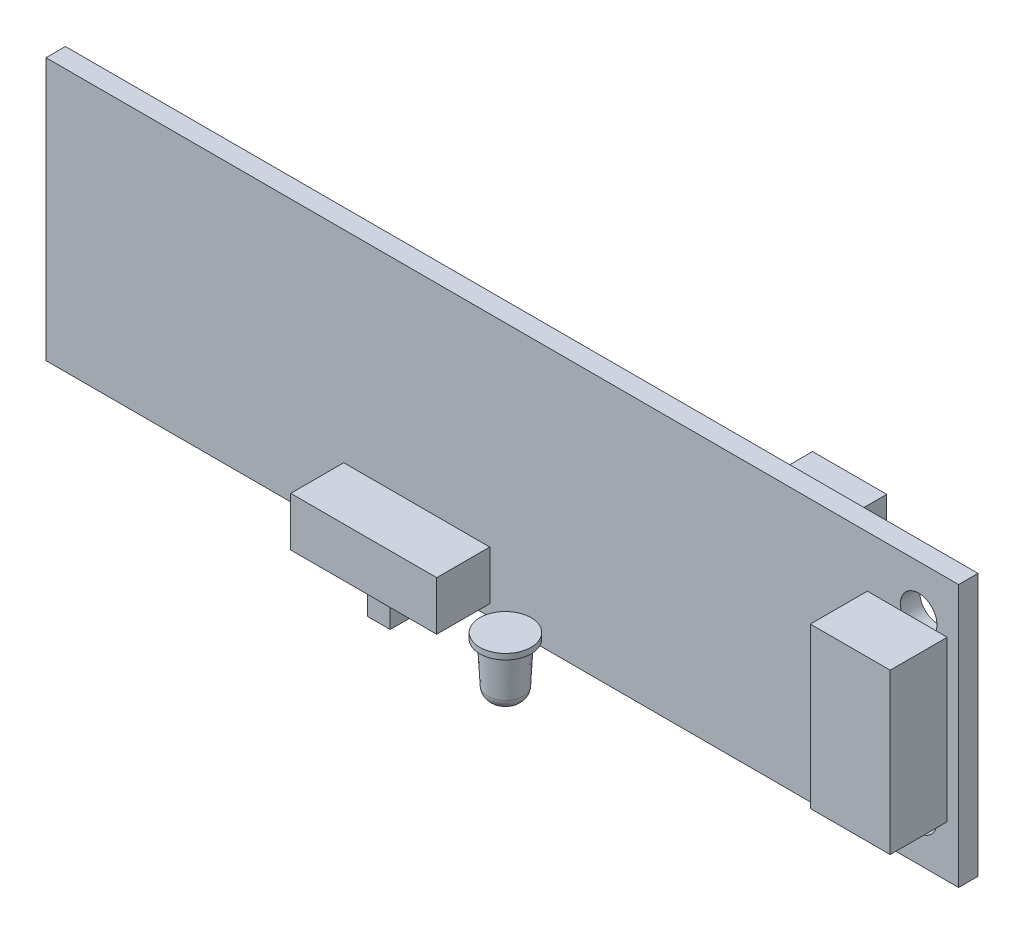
ISO-10303-21;
HEADER;
FILE_DESCRIPTION(('STEP AP214'),'2;1');
FILE_NAME('part.step','',(''),(''),'','','');
FILE_SCHEMA(('AUTOMOTIVE_DESIGN { 1 0 10303 214 1 1 1 1 }'));
ENDSEC;
DATA;
#1=APPLICATION_CONTEXT('core data for automotive mechanical design processes');
#2=APPLICATION_PROTOCOL_DEFINITION('international standard','automotive_design',2000,#1);
#3=PRODUCT_CONTEXT('',#1,'mechanical');
#4=PRODUCT('Part','Part','',(#3));
#5=PRODUCT_RELATED_PRODUCT_CATEGORY('part','',(#4));
#6=PRODUCT_DEFINITION_FORMATION('','',#4);
#7=PRODUCT_DEFINITION_CONTEXT('part definition',#1,'design');
#8=PRODUCT_DEFINITION('design','',#6,#7);
#9=PRODUCT_DEFINITION_SHAPE('','',#8);
#10=(LENGTH_UNIT() NAMED_UNIT(*) SI_UNIT(.MILLI.,.METRE.));
#11=(NAMED_UNIT(*) PLANE_ANGLE_UNIT() SI_UNIT($,.RADIAN.));
#12=(NAMED_UNIT(*) SI_UNIT($,.STERADIAN.) SOLID_ANGLE_UNIT());
#13=UNCERTAINTY_MEASURE_WITH_UNIT(LENGTH_MEASURE(1.E-05),#10,'distance_accuracy_value','');
#14=(GEOMETRIC_REPRESENTATION_CONTEXT(3) GLOBAL_UNCERTAINTY_ASSIGNED_CONTEXT((#13)) GLOBAL_UNIT_ASSIGNED_CONTEXT((#10,
#11,#12)) REPRESENTATION_CONTEXT('',''));
#15=CARTESIAN_POINT('',(0.,0.,0.));
#16=DIRECTION('',(0.,0.,1.));
#17=DIRECTION('',(1.,0.,0.));
#18=AXIS2_PLACEMENT_3D('',#15,#16,#17);
#19=CARTESIAN_POINT('',(3.275,-9.5,4.7));
#20=DIRECTION('',(0.,1.,0.));
#21=DIRECTION('',(0.,0.,-1.));
#22=AXIS2_PLACEMENT_3D('',#19,#20,#21);
#23=CONICAL_SURFACE('',#22,1.75,0.05235987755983);
#24=CARTESIAN_POINT('',(3.275,-13.0523359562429,4.7));
#25=DIRECTION('',(0.,1.,0.));
#26=DIRECTION('',(0.,0.,1.));
#27=AXIS2_PLACEMENT_3D('',#24,#25,#26);
#28=CIRCLE('',#27,1.56382996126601);
#29=CARTESIAN_POINT('',(3.275,-13.0523359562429,6.26382996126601));
#30=VERTEX_POINT('',#29);
#31=EDGE_CURVE('E11',#30,#30,#28,.T.);
#32=ORIENTED_EDGE('',*,*,#31,.T.);
#33=EDGE_LOOP('',(#32));
#34=FACE_BOUND('',#33,.T.);
#35=CARTESIAN_POINT('',(3.275,-9.5,4.7));
#36=DIRECTION('',(0.,1.,0.));
#37=DIRECTION('',(0.,0.,1.));
#38=AXIS2_PLACEMENT_3D('',#35,#36,#37);
#39=CIRCLE('',#38,1.75);
#40=CARTESIAN_POINT('',(3.275,-9.5,6.45));
#41=VERTEX_POINT('',#40);
#42=EDGE_CURVE('E53',#41,#41,#39,.T.);
#43=ORIENTED_EDGE('',*,*,#42,.F.);
#44=EDGE_LOOP('',(#43));
#45=FACE_BOUND('',#44,.T.);
#46=ADVANCED_FACE('F42',(#34,#45),#23,.T.);
#47=CARTESIAN_POINT('',(3.275,-14.,4.7));
#48=DIRECTION('',(0.,-1.,0.));
#49=DIRECTION('',(0.,0.,-1.));
#50=AXIS2_PLACEMENT_3D('',#47,#48,#49);
#51=PLANE('',#50);
#52=CARTESIAN_POINT('',(3.275,-14.,4.7));
#53=DIRECTION('',(0.,-1.,0.));
#54=DIRECTION('',(0.,0.,-1.));
#55=AXIS2_PLACEMENT_3D('',#52,#53,#54);
#56=CIRCLE('',#55,0.565200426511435);
#57=CARTESIAN_POINT('',(3.275,-14.,4.13479957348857));
#58=VERTEX_POINT('',#57);
#59=EDGE_CURVE('E49',#58,#58,#56,.T.);
#60=ORIENTED_EDGE('',*,*,#59,.T.);
#61=EDGE_LOOP('',(#60));
#62=FACE_BOUND('',#61,.T.);
#63=ADVANCED_FACE('F71',(#62),#51,.T.);
#64=CARTESIAN_POINT('',(3.275,-9.,4.7));
#65=DIRECTION('',(0.,-1.,0.));
#66=DIRECTION('',(0.,0.,-1.));
#67=AXIS2_PLACEMENT_3D('',#64,#65,#66);
#68=CYLINDRICAL_SURFACE('',#67,2.25);
#69=CARTESIAN_POINT('',(3.275,-9.,4.7));
#70=DIRECTION('',(0.,1.,0.));
#71=DIRECTION('',(0.,0.,1.));
#72=AXIS2_PLACEMENT_3D('',#69,#70,#71);
#73=CIRCLE('',#72,2.25);
#74=CARTESIAN_POINT('',(3.275,-9.,6.95));
#75=VERTEX_POINT('',#74);
#76=EDGE_CURVE('E57',#75,#75,#73,.T.);
#77=ORIENTED_EDGE('',*,*,#76,.F.);
#78=EDGE_LOOP('',(#77));
#79=FACE_BOUND('',#78,.T.);
#80=CARTESIAN_POINT('',(3.275,-9.5,4.7));
#81=DIRECTION('',(0.,1.,0.));
#82=DIRECTION('',(0.,0.,1.));
#83=AXIS2_PLACEMENT_3D('',#80,#81,#82);
#84=CIRCLE('',#83,2.25);
#85=CARTESIAN_POINT('',(3.275,-9.5,6.95));
#86=VERTEX_POINT('',#85);
#87=EDGE_CURVE('E60',#86,#86,#84,.T.);
#88=ORIENTED_EDGE('',*,*,#87,.T.);
#89=EDGE_LOOP('',(#88));
#90=FACE_BOUND('',#89,.T.);
#91=ADVANCED_FACE('F68',(#79,#90),#68,.T.);
#92=CARTESIAN_POINT('',(3.275,-9.,4.7));
#93=DIRECTION('',(0.,1.,0.));
#94=DIRECTION('',(0.,0.,1.));
#95=AXIS2_PLACEMENT_3D('',#92,#93,#94);
#96=PLANE('',#95);
#97=ORIENTED_EDGE('',*,*,#76,.T.);
#98=EDGE_LOOP('',(#97));
#99=FACE_BOUND('',#98,.T.);
#100=ADVANCED_FACE('F66',(#99),#96,.T.);
#101=CARTESIAN_POINT('',(3.275,-9.5,4.7));
#102=DIRECTION('',(0.,1.,0.));
#103=DIRECTION('',(0.,0.,1.));
#104=AXIS2_PLACEMENT_3D('',#101,#102,#103);
#105=PLANE('',#104);
#106=ORIENTED_EDGE('',*,*,#42,.T.);
#107=EDGE_LOOP('',(#106));
#108=FACE_BOUND('',#107,.T.);
#109=ORIENTED_EDGE('',*,*,#87,.F.);
#110=EDGE_LOOP('',(#109));
#111=FACE_BOUND('',#110,.T.);
#112=ADVANCED_FACE('F75',(#108,#111),#105,.F.);
#113=CARTESIAN_POINT('',(3.275,-13.,4.7));
#114=DIRECTION('',(0.,-1.,0.));
#115=DIRECTION('',(0.,0.,-1.));
#116=AXIS2_PLACEMENT_3D('',#113,#114,#115);
#117=DEGENERATE_TOROIDAL_SURFACE('',#116,0.565200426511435,1.,.T.);
#118=ORIENTED_EDGE('',*,*,#31,.F.);
#119=EDGE_LOOP('',(#118));
#120=FACE_BOUND('',#119,.T.);
#121=ORIENTED_EDGE('',*,*,#59,.F.);
#122=EDGE_LOOP('',(#121));
#123=FACE_BOUND('',#122,.T.);
#124=ADVANCED_FACE('F44',(#120,#123),#117,.T.);
#125=CLOSED_SHELL('',(#46,#63,#91,#100,#112,#124));
#126=MANIFOLD_SOLID_BREP('B2',#125);
#127=CARTESIAN_POINT('',(0.,0.,1.7));
#128=DIRECTION('',(0.,0.,1.));
#129=DIRECTION('',(1.,0.,0.));
#130=AXIS2_PLACEMENT_3D('',#127,#128,#129);
#131=PLANE('',#130);
#132=DIRECTION('',(0.,1.,0.));
#133=VECTOR('',#132,1.);
#134=CARTESIAN_POINT('',(40.,11.5,1.7));
#135=LINE('',#134,#133);
#136=CARTESIAN_POINT('',(40.,-11.5,1.7));
#137=VERTEX_POINT('',#136);
#138=CARTESIAN_POINT('',(40.,11.5,1.7));
#139=VERTEX_POINT('',#138);
#140=EDGE_CURVE('E474',#137,#139,#135,.T.);
#141=ORIENTED_EDGE('',*,*,#140,.T.);
#142=DIRECTION('',(-1.,0.,0.));
#143=VECTOR('',#142,1.);
#144=CARTESIAN_POINT('',(-40.,11.5,1.7));
#145=LINE('',#144,#143);
#146=CARTESIAN_POINT('',(-40.,11.5,1.7));
#147=VERTEX_POINT('',#146);
#148=EDGE_CURVE('E477',#139,#147,#145,.T.);
#149=ORIENTED_EDGE('',*,*,#148,.T.);
#150=DIRECTION('',(0.,-1.,0.));
#151=VECTOR('',#150,1.);
#152=CARTESIAN_POINT('',(-40.,11.5,1.7));
#153=LINE('',#152,#151);
#154=CARTESIAN_POINT('',(-40.,-11.5,1.7));
#155=VERTEX_POINT('',#154);
#156=EDGE_CURVE('E480',#147,#155,#153,.T.);
#157=ORIENTED_EDGE('',*,*,#156,.T.);
#158=DIRECTION('',(1.,0.,0.));
#159=VECTOR('',#158,1.);
#160=CARTESIAN_POINT('',(-40.,-11.5,1.7));
#161=LINE('',#160,#159);
#162=EDGE_CURVE('E482',#155,#137,#161,.T.);
#163=ORIENTED_EDGE('',*,*,#162,.T.);
#164=EDGE_LOOP('',(#141,#149,#157,#163));
#165=FACE_BOUND('',#164,.T.);
#166=DIRECTION('',(-1.,0.,0.));
#167=VECTOR('',#166,1.);
#168=CARTESIAN_POINT('',(-13.9,-6.2,1.7));
#169=LINE('',#168,#167);
#170=CARTESIAN_POINT('',(-1.1,-6.2,1.7));
#171=VERTEX_POINT('',#170);
#172=CARTESIAN_POINT('',(-13.9,-6.2,1.7));
#173=VERTEX_POINT('',#172);
#174=EDGE_CURVE('E444',#171,#173,#169,.T.);
#175=ORIENTED_EDGE('',*,*,#174,.F.);
#176=DIRECTION('',(0.,1.,0.));
#177=VECTOR('',#176,1.);
#178=CARTESIAN_POINT('',(-1.1,-6.2,1.7));
#179=LINE('',#178,#177);
#180=CARTESIAN_POINT('',(-1.1,-10.5,1.7));
#181=VERTEX_POINT('',#180);
#182=EDGE_CURVE('E430',#181,#171,#179,.T.);
#183=ORIENTED_EDGE('',*,*,#182,.F.);
#184=DIRECTION('',(1.,0.,0.));
#185=VECTOR('',#184,1.);
#186=CARTESIAN_POINT('',(-13.9,-10.5,1.7));
#187=LINE('',#186,#185);
#188=CARTESIAN_POINT('',(-13.9,-10.5,1.7));
#189=VERTEX_POINT('',#188);
#190=EDGE_CURVE('E435',#189,#181,#187,.T.);
#191=ORIENTED_EDGE('',*,*,#190,.F.);
#192=DIRECTION('',(0.,-1.,0.));
#193=VECTOR('',#192,1.);
#194=CARTESIAN_POINT('',(-13.9,-6.2,1.7));
#195=LINE('',#194,#193);
#196=EDGE_CURVE('E446',#173,#189,#195,.T.);
#197=ORIENTED_EDGE('',*,*,#196,.F.);
#198=EDGE_LOOP('',(#175,#183,#191,#197));
#199=FACE_BOUND('',#198,.T.);
#200=CARTESIAN_POINT('',(36.5,7.5,1.7));
#201=DIRECTION('',(0.,0.,1.));
#202=DIRECTION('',(1.,0.,0.));
#203=AXIS2_PLACEMENT_3D('',#200,#201,#202);
#204=CIRCLE('',#203,1.6);
#205=CARTESIAN_POINT('',(38.0198684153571,6.99999999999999,1.7));
#206=VERTEX_POINT('',#205);
#207=CARTESIAN_POINT('',(34.9801315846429,6.99999999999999,1.7));
#208=VERTEX_POINT('',#207);
#209=EDGE_CURVE('E466',#206,#208,#204,.T.);
#210=ORIENTED_EDGE('',*,*,#209,.F.);
#211=DIRECTION('',(-1.,0.,0.));
#212=VECTOR('',#211,1.);
#213=CARTESIAN_POINT('',(32.,6.99999999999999,1.7));
#214=LINE('',#213,#212);
#215=CARTESIAN_POINT('',(39.,6.99999999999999,1.7));
#216=VERTEX_POINT('',#215);
#217=EDGE_CURVE('E880',#216,#206,#214,.T.);
#218=ORIENTED_EDGE('',*,*,#217,.F.);
#219=DIRECTION('',(0.,1.,0.));
#220=VECTOR('',#219,1.);
#221=CARTESIAN_POINT('',(39.,6.99999999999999,1.7));
#222=LINE('',#221,#220);
#223=CARTESIAN_POINT('',(39.,-7.00000000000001,1.7));
#224=VERTEX_POINT('',#223);
#225=EDGE_CURVE('E326',#224,#216,#222,.T.);
#226=ORIENTED_EDGE('',*,*,#225,.F.);
#227=DIRECTION('',(1.,0.,0.));
#228=VECTOR('',#227,1.);
#229=CARTESIAN_POINT('',(32.,-7.00000000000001,1.7));
#230=LINE('',#229,#228);
#231=CARTESIAN_POINT('',(38.0198684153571,-7.00000000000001,1.7));
#232=VERTEX_POINT('',#231);
#233=EDGE_CURVE('E879',#232,#224,#230,.T.);
#234=ORIENTED_EDGE('',*,*,#233,.F.);
#235=CARTESIAN_POINT('',(36.5,-7.5,1.7));
#236=DIRECTION('',(0.,0.,1.));
#237=DIRECTION('',(-1.,0.,0.));
#238=AXIS2_PLACEMENT_3D('',#235,#236,#237);
#239=CIRCLE('',#238,1.6);
#240=CARTESIAN_POINT('',(34.9801315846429,-7.00000000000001,1.7));
#241=VERTEX_POINT('',#240);
#242=EDGE_CURVE('E459',#241,#232,#239,.T.);
#243=ORIENTED_EDGE('',*,*,#242,.F.);
#244=CARTESIAN_POINT('',(32.,-7.00000000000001,1.7));
#245=VERTEX_POINT('',#244);
#246=EDGE_CURVE('E143',#245,#241,#230,.T.);
#247=ORIENTED_EDGE('',*,*,#246,.F.);
#248=DIRECTION('',(0.,-1.,0.));
#249=VECTOR('',#248,1.);
#250=CARTESIAN_POINT('',(32.,6.99999999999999,1.7));
#251=LINE('',#250,#249);
#252=CARTESIAN_POINT('',(32.,6.99999999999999,1.7));
#253=VERTEX_POINT('',#252);
#254=EDGE_CURVE('E877',#253,#245,#251,.T.);
#255=ORIENTED_EDGE('',*,*,#254,.F.);
#256=EDGE_CURVE('E890',#208,#253,#214,.T.);
#257=ORIENTED_EDGE('',*,*,#256,.F.);
#258=EDGE_LOOP('',(#210,#218,#226,#234,#243,#247,#255,#257));
#259=FACE_BOUND('',#258,.T.);
#260=ADVANCED_FACE('F128',(#165,#199,#259),#131,.T.);
#261=CARTESIAN_POINT('',(-13.9,-10.5,6.35));
#262=DIRECTION('',(0.,1.,0.));
#263=DIRECTION('',(0.,0.,1.));
#264=AXIS2_PLACEMENT_3D('',#261,#262,#263);
#265=PLANE('',#264);
#266=ORIENTED_EDGE('',*,*,#190,.T.);
#267=DIRECTION('',(0.,0.,-1.));
#268=VECTOR('',#267,1.);
#269=CARTESIAN_POINT('',(-1.1,-10.5,6.35));
#270=LINE('',#269,#268);
#271=CARTESIAN_POINT('',(-1.1,-10.5,6.35));
#272=VERTEX_POINT('',#271);
#273=EDGE_CURVE('E441',#272,#181,#270,.T.);
#274=ORIENTED_EDGE('',*,*,#273,.F.);
#275=DIRECTION('',(1.,0.,0.));
#276=VECTOR('',#275,1.);
#277=CARTESIAN_POINT('',(-13.9,-10.5,6.35));
#278=LINE('',#277,#276);
#279=CARTESIAN_POINT('',(-13.9,-10.5,6.35));
#280=VERTEX_POINT('',#279);
#281=EDGE_CURVE('E439',#280,#272,#278,.T.);
#282=ORIENTED_EDGE('',*,*,#281,.F.);
#283=DIRECTION('',(0.,0.,-1.));
#284=VECTOR('',#283,1.);
#285=CARTESIAN_POINT('',(-13.9,-10.5,6.35));
#286=LINE('',#285,#284);
#287=EDGE_CURVE('E452',#280,#189,#286,.T.);
#288=ORIENTED_EDGE('',*,*,#287,.T.);
#289=EDGE_LOOP('',(#266,#274,#282,#288));
#290=FACE_BOUND('',#289,.T.);
#291=DIRECTION('',(0.,0.,1.));
#292=VECTOR('',#291,1.);
#293=CARTESIAN_POINT('',(-6.5,-10.5,5.025));
#294=LINE('',#293,#292);
#295=CARTESIAN_POINT('',(-6.5,-10.5,3.025));
#296=VERTEX_POINT('',#295);
#297=CARTESIAN_POINT('',(-6.5,-10.5,5.025));
#298=VERTEX_POINT('',#297);
#299=EDGE_CURVE('E328',#296,#298,#294,.T.);
#300=ORIENTED_EDGE('',*,*,#299,.F.);
#301=DIRECTION('',(1.,0.,0.));
#302=VECTOR('',#301,1.);
#303=CARTESIAN_POINT('',(-8.5,-10.5,3.025));
#304=LINE('',#303,#302);
#305=CARTESIAN_POINT('',(-8.5,-10.5,3.025));
#306=VERTEX_POINT('',#305);
#307=EDGE_CURVE('E340',#306,#296,#304,.T.);
#308=ORIENTED_EDGE('',*,*,#307,.F.);
#309=DIRECTION('',(0.,0.,-1.));
#310=VECTOR('',#309,1.);
#311=CARTESIAN_POINT('',(-8.5,-10.5,5.025));
#312=LINE('',#311,#310);
#313=CARTESIAN_POINT('',(-8.5,-10.5,5.025));
#314=VERTEX_POINT('',#313);
#315=EDGE_CURVE('E348',#314,#306,#312,.T.);
#316=ORIENTED_EDGE('',*,*,#315,.F.);
#317=DIRECTION('',(-1.,0.,0.));
#318=VECTOR('',#317,1.);
#319=CARTESIAN_POINT('',(-8.5,-10.5,5.025));
#320=LINE('',#319,#318);
#321=EDGE_CURVE('E151',#298,#314,#320,.T.);
#322=ORIENTED_EDGE('',*,*,#321,.F.);
#323=EDGE_LOOP('',(#300,#308,#316,#322));
#324=FACE_BOUND('',#323,.T.);
#325=ADVANCED_FACE('F526',(#290,#324),#265,.F.);
#326=CARTESIAN_POINT('',(0.,0.,-1.));
#327=DIRECTION('',(0.,0.,-1.));
#328=DIRECTION('',(-1.,0.,0.));
#329=AXIS2_PLACEMENT_3D('',#326,#327,#328);
#330=PLANE('',#329);
#331=DIRECTION('',(0.,1.,0.));
#332=VECTOR('',#331,1.);
#333=CARTESIAN_POINT('',(18.5,-6.5,-1.));
#334=LINE('',#333,#332);
#335=CARTESIAN_POINT('',(18.5,-2.5,-1.));
#336=VERTEX_POINT('',#335);
#337=CARTESIAN_POINT('',(18.5,2.5,-1.));
#338=VERTEX_POINT('',#337);
#339=EDGE_CURVE('E405',#336,#338,#334,.T.);
#340=ORIENTED_EDGE('',*,*,#339,.T.);
#341=DIRECTION('',(-1.,0.,0.));
#342=VECTOR('',#341,1.);
#343=CARTESIAN_POINT('',(18.5,2.5,-1.));
#344=LINE('',#343,#342);
#345=CARTESIAN_POINT('',(25.,2.5,-1.));
#346=VERTEX_POINT('',#345);
#347=EDGE_CURVE('E363',#346,#338,#344,.T.);
#348=ORIENTED_EDGE('',*,*,#347,.F.);
#349=DIRECTION('',(0.,-1.,0.));
#350=VECTOR('',#349,1.);
#351=CARTESIAN_POINT('',(25.,-6.5,-1.));
#352=LINE('',#351,#350);
#353=CARTESIAN_POINT('',(25.,-2.5,-1.));
#354=VERTEX_POINT('',#353);
#355=EDGE_CURVE('E403',#346,#354,#352,.T.);
#356=ORIENTED_EDGE('',*,*,#355,.T.);
#357=DIRECTION('',(1.,0.,0.));
#358=VECTOR('',#357,1.);
#359=CARTESIAN_POINT('',(18.5,-2.5,-1.));
#360=LINE('',#359,#358);
#361=EDGE_CURVE('E382',#336,#354,#360,.T.);
#362=ORIENTED_EDGE('',*,*,#361,.F.);
#363=EDGE_LOOP('',(#340,#348,#356,#362));
#364=FACE_BOUND('',#363,.T.);
#365=ADVANCED_FACE('F533',(#364),#330,.T.);
#366=CARTESIAN_POINT('',(0.,0.,0.));
#367=DIRECTION('',(0.,0.,1.));
#368=DIRECTION('',(1.,0.,0.));
#369=AXIS2_PLACEMENT_3D('',#366,#367,#368);
#370=PLANE('',#369);
#371=DIRECTION('',(0.,1.,0.));
#372=VECTOR('',#371,1.);
#373=CARTESIAN_POINT('',(40.,11.5,0.));
#374=LINE('',#373,#372);
#375=CARTESIAN_POINT('',(40.,-11.5,0.));
#376=VERTEX_POINT('',#375);
#377=CARTESIAN_POINT('',(40.,11.5,0.));
#378=VERTEX_POINT('',#377);
#379=EDGE_CURVE('E473',#376,#378,#374,.T.);
#380=ORIENTED_EDGE('',*,*,#379,.F.);
#381=DIRECTION('',(1.,0.,0.));
#382=VECTOR('',#381,1.);
#383=CARTESIAN_POINT('',(-40.,-11.5,0.));
#384=LINE('',#383,#382);
#385=CARTESIAN_POINT('',(-40.,-11.5,0.));
#386=VERTEX_POINT('',#385);
#387=EDGE_CURVE('E478',#386,#376,#384,.T.);
#388=ORIENTED_EDGE('',*,*,#387,.F.);
#389=DIRECTION('',(0.,-1.,0.));
#390=VECTOR('',#389,1.);
#391=CARTESIAN_POINT('',(-40.,11.5,0.));
#392=LINE('',#391,#390);
#393=CARTESIAN_POINT('',(-40.,11.5,0.));
#394=VERTEX_POINT('',#393);
#395=EDGE_CURVE('E489',#394,#386,#392,.T.);
#396=ORIENTED_EDGE('',*,*,#395,.F.);
#397=DIRECTION('',(-1.,0.,0.));
#398=VECTOR('',#397,1.);
#399=CARTESIAN_POINT('',(-40.,11.5,0.));
#400=LINE('',#399,#398);
#401=EDGE_CURVE('E487',#378,#394,#400,.T.);
#402=ORIENTED_EDGE('',*,*,#401,.F.);
#403=EDGE_LOOP('',(#380,#388,#396,#402));
#404=FACE_BOUND('',#403,.T.);
#405=CARTESIAN_POINT('',(36.5,7.5,0.));
#406=DIRECTION('',(0.,0.,1.));
#407=DIRECTION('',(1.,0.,0.));
#408=AXIS2_PLACEMENT_3D('',#405,#406,#407);
#409=CIRCLE('',#408,1.6);
#410=CARTESIAN_POINT('',(38.1,7.5,0.));
#411=VERTEX_POINT('',#410);
#412=EDGE_CURVE('E470',#411,#411,#409,.F.);
#413=ORIENTED_EDGE('',*,*,#412,.F.);
#414=EDGE_LOOP('',(#413));
#415=FACE_BOUND('',#414,.T.);
#416=CARTESIAN_POINT('',(36.5,-7.5,0.));
#417=DIRECTION('',(0.,0.,1.));
#418=DIRECTION('',(1.,0.,0.));
#419=AXIS2_PLACEMENT_3D('',#416,#417,#418);
#420=CIRCLE('',#419,1.6);
#421=CARTESIAN_POINT('',(38.1,-7.5,0.));
#422=VERTEX_POINT('',#421);
#423=EDGE_CURVE('E463',#422,#422,#420,.F.);
#424=ORIENTED_EDGE('',*,*,#423,.F.);
#425=EDGE_LOOP('',(#424));
#426=FACE_BOUND('',#425,.T.);
#427=DIRECTION('',(0.,-1.,0.));
#428=VECTOR('',#427,1.);
#429=CARTESIAN_POINT('',(25.,-6.5,0.));
#430=LINE('',#429,#428);
#431=CARTESIAN_POINT('',(25.,6.5,0.));
#432=VERTEX_POINT('',#431);
#433=CARTESIAN_POINT('',(25.,-6.5,0.));
#434=VERTEX_POINT('',#433);
#435=EDGE_CURVE('E402',#432,#434,#430,.T.);
#436=ORIENTED_EDGE('',*,*,#435,.F.);
#437=DIRECTION('',(1.,0.,0.));
#438=VECTOR('',#437,1.);
#439=CARTESIAN_POINT('',(18.5,6.5,0.));
#440=LINE('',#439,#438);
#441=CARTESIAN_POINT('',(18.5,6.5,0.));
#442=VERTEX_POINT('',#441);
#443=EDGE_CURVE('E406',#442,#432,#440,.T.);
#444=ORIENTED_EDGE('',*,*,#443,.F.);
#445=DIRECTION('',(0.,1.,0.));
#446=VECTOR('',#445,1.);
#447=CARTESIAN_POINT('',(18.5,-6.5,0.));
#448=LINE('',#447,#446);
#449=CARTESIAN_POINT('',(18.5,-6.5,0.));
#450=VERTEX_POINT('',#449);
#451=EDGE_CURVE('E414',#450,#442,#448,.T.);
#452=ORIENTED_EDGE('',*,*,#451,.F.);
#453=DIRECTION('',(-1.,0.,0.));
#454=VECTOR('',#453,1.);
#455=CARTESIAN_POINT('',(18.5,-6.5,0.));
#456=LINE('',#455,#454);
#457=EDGE_CURVE('E411',#434,#450,#456,.T.);
#458=ORIENTED_EDGE('',*,*,#457,.F.);
#459=EDGE_LOOP('',(#436,#444,#452,#458));
#460=FACE_BOUND('',#459,.T.);
#461=ADVANCED_FACE('F507',(#404,#415,#426,#460),#370,.F.);
#462=CARTESIAN_POINT('',(40.,11.5,1.7));
#463=DIRECTION('',(-1.,0.,0.));
#464=DIRECTION('',(0.,0.,1.));
#465=AXIS2_PLACEMENT_3D('',#462,#463,#464);
#466=PLANE('',#465);
#467=ORIENTED_EDGE('',*,*,#379,.T.);
#468=DIRECTION('',(0.,0.,-1.));
#469=VECTOR('',#468,1.);
#470=CARTESIAN_POINT('',(40.,11.5,1.7));
#471=LINE('',#470,#469);
#472=EDGE_CURVE('E40',#139,#378,#471,.T.);
#473=ORIENTED_EDGE('',*,*,#472,.F.);
#474=ORIENTED_EDGE('',*,*,#140,.F.);
#475=DIRECTION('',(0.,0.,-1.));
#476=VECTOR('',#475,1.);
#477=CARTESIAN_POINT('',(40.,-11.5,1.7));
#478=LINE('',#477,#476);
#479=EDGE_CURVE('E484',#137,#376,#478,.T.);
#480=ORIENTED_EDGE('',*,*,#479,.T.);
#481=EDGE_LOOP('',(#467,#473,#474,#480));
#482=FACE_BOUND('',#481,.T.);
#483=ADVANCED_FACE('F130',(#482),#466,.F.);
#484=CARTESIAN_POINT('',(-40.,11.5,1.7));
#485=DIRECTION('',(0.,-1.,0.));
#486=DIRECTION('',(0.,0.,-1.));
#487=AXIS2_PLACEMENT_3D('',#484,#485,#486);
#488=PLANE('',#487);
#489=ORIENTED_EDGE('',*,*,#401,.T.);
#490=DIRECTION('',(0.,0.,-1.));
#491=VECTOR('',#490,1.);
#492=CARTESIAN_POINT('',(-40.,11.5,1.7));
#493=LINE('',#492,#491);
#494=EDGE_CURVE('E136',#147,#394,#493,.T.);
#495=ORIENTED_EDGE('',*,*,#494,.F.);
#496=ORIENTED_EDGE('',*,*,#148,.F.);
#497=ORIENTED_EDGE('',*,*,#472,.T.);
#498=EDGE_LOOP('',(#489,#495,#496,#497));
#499=FACE_BOUND('',#498,.T.);
#500=ADVANCED_FACE('F518',(#499),#488,.F.);
#501=CARTESIAN_POINT('',(-40.,11.5,1.7));
#502=DIRECTION('',(1.,0.,0.));
#503=DIRECTION('',(0.,0.,-1.));
#504=AXIS2_PLACEMENT_3D('',#501,#502,#503);
#505=PLANE('',#504);
#506=ORIENTED_EDGE('',*,*,#395,.T.);
#507=DIRECTION('',(0.,0.,-1.));
#508=VECTOR('',#507,1.);
#509=CARTESIAN_POINT('',(-40.,-11.5,1.7));
#510=LINE('',#509,#508);
#511=EDGE_CURVE('E494',#155,#386,#510,.T.);
#512=ORIENTED_EDGE('',*,*,#511,.F.);
#513=ORIENTED_EDGE('',*,*,#156,.F.);
#514=ORIENTED_EDGE('',*,*,#494,.T.);
#515=EDGE_LOOP('',(#506,#512,#513,#514));
#516=FACE_BOUND('',#515,.T.);
#517=ADVANCED_FACE('F501',(#516),#505,.F.);
#518=CARTESIAN_POINT('',(-40.,-11.5,1.7));
#519=DIRECTION('',(0.,1.,0.));
#520=DIRECTION('',(0.,0.,1.));
#521=AXIS2_PLACEMENT_3D('',#518,#519,#520);
#522=PLANE('',#521);
#523=ORIENTED_EDGE('',*,*,#387,.T.);
#524=ORIENTED_EDGE('',*,*,#479,.F.);
#525=ORIENTED_EDGE('',*,*,#162,.F.);
#526=ORIENTED_EDGE('',*,*,#511,.T.);
#527=EDGE_LOOP('',(#523,#524,#525,#526));
#528=FACE_BOUND('',#527,.T.);
#529=ADVANCED_FACE('F511',(#528),#522,.F.);
#530=CARTESIAN_POINT('',(36.5,7.5,-0.000999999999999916));
#531=DIRECTION('',(0.,0.,1.));
#532=DIRECTION('',(1.,0.,0.));
#533=AXIS2_PLACEMENT_3D('',#530,#531,#532);
#534=CYLINDRICAL_SURFACE('',#533,1.6);
#535=EDGE_CURVE('E467',#208,#206,#204,.T.);
#536=ORIENTED_EDGE('',*,*,#535,.T.);
#537=ORIENTED_EDGE('',*,*,#209,.T.);
#538=EDGE_LOOP('',(#536,#537));
#539=FACE_BOUND('',#538,.T.);
#540=ORIENTED_EDGE('',*,*,#412,.T.);
#541=EDGE_LOOP('',(#540));
#542=FACE_BOUND('',#541,.T.);
#543=ADVANCED_FACE('F538',(#539,#542),#534,.F.);
#544=CARTESIAN_POINT('',(36.5,-7.5,-0.000999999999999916));
#545=DIRECTION('',(0.,0.,1.));
#546=DIRECTION('',(1.,0.,0.));
#547=AXIS2_PLACEMENT_3D('',#544,#545,#546);
#548=CYLINDRICAL_SURFACE('',#547,1.6);
#549=EDGE_CURVE('E460',#232,#241,#239,.T.);
#550=ORIENTED_EDGE('',*,*,#549,.T.);
#551=ORIENTED_EDGE('',*,*,#242,.T.);
#552=EDGE_LOOP('',(#550,#551));
#553=FACE_BOUND('',#552,.T.);
#554=ORIENTED_EDGE('',*,*,#423,.T.);
#555=EDGE_LOOP('',(#554));
#556=FACE_BOUND('',#555,.T.);
#557=ADVANCED_FACE('F546',(#553,#556),#548,.F.);
#558=CARTESIAN_POINT('',(-1.1,-6.2,6.35));
#559=DIRECTION('',(-1.,0.,0.));
#560=DIRECTION('',(0.,-1.,0.));
#561=AXIS2_PLACEMENT_3D('',#558,#559,#560);
#562=PLANE('',#561);
#563=ORIENTED_EDGE('',*,*,#182,.T.);
#564=DIRECTION('',(0.,0.,-1.));
#565=VECTOR('',#564,1.);
#566=CARTESIAN_POINT('',(-1.1,-6.2,6.35));
#567=LINE('',#566,#565);
#568=CARTESIAN_POINT('',(-1.1,-6.2,6.35));
#569=VERTEX_POINT('',#568);
#570=EDGE_CURVE('E457',#569,#171,#567,.T.);
#571=ORIENTED_EDGE('',*,*,#570,.F.);
#572=DIRECTION('',(0.,1.,0.));
#573=VECTOR('',#572,1.);
#574=CARTESIAN_POINT('',(-1.1,-6.2,6.35));
#575=LINE('',#574,#573);
#576=EDGE_CURVE('E431',#272,#569,#575,.T.);
#577=ORIENTED_EDGE('',*,*,#576,.F.);
#578=ORIENTED_EDGE('',*,*,#273,.T.);
#579=EDGE_LOOP('',(#563,#571,#577,#578));
#580=FACE_BOUND('',#579,.T.);
#581=ADVANCED_FACE('F550',(#580),#562,.F.);
#582=CARTESIAN_POINT('',(-13.9,-6.2,6.35));
#583=DIRECTION('',(0.,-1.,0.));
#584=DIRECTION('',(0.,0.,-1.));
#585=AXIS2_PLACEMENT_3D('',#582,#583,#584);
#586=PLANE('',#585);
#587=ORIENTED_EDGE('',*,*,#174,.T.);
#588=DIRECTION('',(0.,0.,-1.));
#589=VECTOR('',#588,1.);
#590=CARTESIAN_POINT('',(-13.9,-6.2,6.35));
#591=LINE('',#590,#589);
#592=CARTESIAN_POINT('',(-13.9,-6.2,6.35));
#593=VERTEX_POINT('',#592);
#594=EDGE_CURVE('E454',#593,#173,#591,.T.);
#595=ORIENTED_EDGE('',*,*,#594,.F.);
#596=DIRECTION('',(-1.,0.,0.));
#597=VECTOR('',#596,1.);
#598=CARTESIAN_POINT('',(-13.9,-6.2,6.35));
#599=LINE('',#598,#597);
#600=EDGE_CURVE('E434',#569,#593,#599,.T.);
#601=ORIENTED_EDGE('',*,*,#600,.F.);
#602=ORIENTED_EDGE('',*,*,#570,.T.);
#603=EDGE_LOOP('',(#587,#595,#601,#602));
#604=FACE_BOUND('',#603,.T.);
#605=ADVANCED_FACE('F610',(#604),#586,.F.);
#606=CARTESIAN_POINT('',(-13.9,-6.2,6.35));
#607=DIRECTION('',(1.,0.,0.));
#608=DIRECTION('',(0.,0.,-1.));
#609=AXIS2_PLACEMENT_3D('',#606,#607,#608);
#610=PLANE('',#609);
#611=ORIENTED_EDGE('',*,*,#196,.T.);
#612=ORIENTED_EDGE('',*,*,#287,.F.);
#613=DIRECTION('',(0.,-1.,0.));
#614=VECTOR('',#613,1.);
#615=CARTESIAN_POINT('',(-13.9,-6.2,6.35));
#616=LINE('',#615,#614);
#617=EDGE_CURVE('E437',#593,#280,#616,.T.);
#618=ORIENTED_EDGE('',*,*,#617,.F.);
#619=ORIENTED_EDGE('',*,*,#594,.T.);
#620=EDGE_LOOP('',(#611,#612,#618,#619));
#621=FACE_BOUND('',#620,.T.);
#622=ADVANCED_FACE('F605',(#621),#610,.F.);
#623=CARTESIAN_POINT('',(0.,0.,6.35));
#624=DIRECTION('',(0.,0.,1.));
#625=DIRECTION('',(1.,0.,0.));
#626=AXIS2_PLACEMENT_3D('',#623,#624,#625);
#627=PLANE('',#626);
#628=ORIENTED_EDGE('',*,*,#576,.T.);
#629=ORIENTED_EDGE('',*,*,#600,.T.);
#630=ORIENTED_EDGE('',*,*,#617,.T.);
#631=ORIENTED_EDGE('',*,*,#281,.T.);
#632=EDGE_LOOP('',(#628,#629,#630,#631));
#633=FACE_BOUND('',#632,.T.);
#634=ADVANCED_FACE('F603',(#633),#627,.T.);
#635=CARTESIAN_POINT('',(25.,-6.5,-1.));
#636=DIRECTION('',(-1.,0.,0.));
#637=DIRECTION('',(0.,0.,1.));
#638=AXIS2_PLACEMENT_3D('',#635,#636,#637);
#639=PLANE('',#638);
#640=ORIENTED_EDGE('',*,*,#435,.T.);
#641=DIRECTION('',(0.,0.,1.));
#642=VECTOR('',#641,1.);
#643=CARTESIAN_POINT('',(25.,-6.5,-1.));
#644=LINE('',#643,#642);
#645=CARTESIAN_POINT('',(25.,-6.5,-7.));
#646=VERTEX_POINT('',#645);
#647=EDGE_CURVE('E427',#646,#434,#644,.T.);
#648=ORIENTED_EDGE('',*,*,#647,.F.);
#649=DIRECTION('',(0.,-1.,0.));
#650=VECTOR('',#649,1.);
#651=CARTESIAN_POINT('',(25.,-6.5,-7.));
#652=LINE('',#651,#650);
#653=CARTESIAN_POINT('',(25.,-2.5,-7.));
#654=VERTEX_POINT('',#653);
#655=EDGE_CURVE('E388',#654,#646,#652,.T.);
#656=ORIENTED_EDGE('',*,*,#655,.F.);
#657=DIRECTION('',(0.,0.,1.));
#658=VECTOR('',#657,1.);
#659=CARTESIAN_POINT('',(25.,-2.5,-7.));
#660=LINE('',#659,#658);
#661=EDGE_CURVE('E394',#654,#354,#660,.T.);
#662=ORIENTED_EDGE('',*,*,#661,.T.);
#663=ORIENTED_EDGE('',*,*,#355,.F.);
#664=DIRECTION('',(0.,0.,1.));
#665=VECTOR('',#664,1.);
#666=CARTESIAN_POINT('',(25.,2.5,-7.));
#667=LINE('',#666,#665);
#668=CARTESIAN_POINT('',(25.,2.5,-7.));
#669=VERTEX_POINT('',#668);
#670=EDGE_CURVE('E379',#669,#346,#667,.T.);
#671=ORIENTED_EDGE('',*,*,#670,.F.);
#672=DIRECTION('',(0.,-1.,0.));
#673=VECTOR('',#672,1.);
#674=CARTESIAN_POINT('',(25.,6.5,-7.));
#675=LINE('',#674,#673);
#676=CARTESIAN_POINT('',(25.,6.5,-7.));
#677=VERTEX_POINT('',#676);
#678=EDGE_CURVE('E367',#677,#669,#675,.T.);
#679=ORIENTED_EDGE('',*,*,#678,.F.);
#680=DIRECTION('',(0.,0.,1.));
#681=VECTOR('',#680,1.);
#682=CARTESIAN_POINT('',(25.,6.5,-1.));
#683=LINE('',#682,#681);
#684=EDGE_CURVE('E408',#677,#432,#683,.T.);
#685=ORIENTED_EDGE('',*,*,#684,.T.);
#686=EDGE_LOOP('',(#640,#648,#656,#662,#663,#671,#679,#685));
#687=FACE_BOUND('',#686,.T.);
#688=ADVANCED_FACE('F563',(#687),#639,.F.);
#689=CARTESIAN_POINT('',(18.5,-6.5,-1.));
#690=DIRECTION('',(0.,1.,0.));
#691=DIRECTION('',(-1.,0.,0.));
#692=AXIS2_PLACEMENT_3D('',#689,#690,#691);
#693=PLANE('',#692);
#694=ORIENTED_EDGE('',*,*,#457,.T.);
#695=DIRECTION('',(0.,0.,1.));
#696=VECTOR('',#695,1.);
#697=CARTESIAN_POINT('',(18.5,-6.5,-1.));
#698=LINE('',#697,#696);
#699=CARTESIAN_POINT('',(18.5,-6.5,-7.));
#700=VERTEX_POINT('',#699);
#701=EDGE_CURVE('E424',#700,#450,#698,.T.);
#702=ORIENTED_EDGE('',*,*,#701,.F.);
#703=DIRECTION('',(-1.,0.,0.));
#704=VECTOR('',#703,1.);
#705=CARTESIAN_POINT('',(18.5,-6.5,-7.));
#706=LINE('',#705,#704);
#707=EDGE_CURVE('E391',#646,#700,#706,.T.);
#708=ORIENTED_EDGE('',*,*,#707,.F.);
#709=ORIENTED_EDGE('',*,*,#647,.T.);
#710=EDGE_LOOP('',(#694,#702,#708,#709));
#711=FACE_BOUND('',#710,.T.);
#712=ADVANCED_FACE('F576',(#711),#693,.F.);
#713=CARTESIAN_POINT('',(18.5,-6.5,-1.));
#714=DIRECTION('',(1.,0.,0.));
#715=DIRECTION('',(0.,0.,-1.));
#716=AXIS2_PLACEMENT_3D('',#713,#714,#715);
#717=PLANE('',#716);
#718=ORIENTED_EDGE('',*,*,#451,.T.);
#719=DIRECTION('',(0.,0.,1.));
#720=VECTOR('',#719,1.);
#721=CARTESIAN_POINT('',(18.5,6.5,-1.));
#722=LINE('',#721,#720);
#723=CARTESIAN_POINT('',(18.5,6.5,-7.));
#724=VERTEX_POINT('',#723);
#725=EDGE_CURVE('E421',#724,#442,#722,.T.);
#726=ORIENTED_EDGE('',*,*,#725,.F.);
#727=DIRECTION('',(0.,1.,0.));
#728=VECTOR('',#727,1.);
#729=CARTESIAN_POINT('',(18.5,6.5,-7.));
#730=LINE('',#729,#728);
#731=CARTESIAN_POINT('',(18.5,2.5,-7.));
#732=VERTEX_POINT('',#731);
#733=EDGE_CURVE('E371',#732,#724,#730,.T.);
#734=ORIENTED_EDGE('',*,*,#733,.F.);
#735=DIRECTION('',(0.,0.,1.));
#736=VECTOR('',#735,1.);
#737=CARTESIAN_POINT('',(18.5,2.5,-7.));
#738=LINE('',#737,#736);
#739=EDGE_CURVE('E374',#732,#338,#738,.T.);
#740=ORIENTED_EDGE('',*,*,#739,.T.);
#741=ORIENTED_EDGE('',*,*,#339,.F.);
#742=DIRECTION('',(0.,0.,1.));
#743=VECTOR('',#742,1.);
#744=CARTESIAN_POINT('',(18.5,-2.5,-7.));
#745=LINE('',#744,#743);
#746=CARTESIAN_POINT('',(18.5,-2.5,-7.));
#747=VERTEX_POINT('',#746);
#748=EDGE_CURVE('E399',#747,#336,#745,.T.);
#749=ORIENTED_EDGE('',*,*,#748,.F.);
#750=DIRECTION('',(0.,1.,0.));
#751=VECTOR('',#750,1.);
#752=CARTESIAN_POINT('',(18.5,-6.5,-7.));
#753=LINE('',#752,#751);
#754=EDGE_CURVE('E383',#700,#747,#753,.T.);
#755=ORIENTED_EDGE('',*,*,#754,.F.);
#756=ORIENTED_EDGE('',*,*,#701,.T.);
#757=EDGE_LOOP('',(#718,#726,#734,#740,#741,#749,#755,#756));
#758=FACE_BOUND('',#757,.T.);
#759=ADVANCED_FACE('F572',(#758),#717,.F.);
#760=CARTESIAN_POINT('',(18.5,6.5,-1.));
#761=DIRECTION('',(0.,-1.,0.));
#762=DIRECTION('',(1.,0.,0.));
#763=AXIS2_PLACEMENT_3D('',#760,#761,#762);
#764=PLANE('',#763);
#765=ORIENTED_EDGE('',*,*,#443,.T.);
#766=ORIENTED_EDGE('',*,*,#684,.F.);
#767=DIRECTION('',(1.,0.,0.));
#768=VECTOR('',#767,1.);
#769=CARTESIAN_POINT('',(18.5,6.5,-7.));
#770=LINE('',#769,#768);
#771=EDGE_CURVE('E364',#724,#677,#770,.T.);
#772=ORIENTED_EDGE('',*,*,#771,.F.);
#773=ORIENTED_EDGE('',*,*,#725,.T.);
#774=EDGE_LOOP('',(#765,#766,#772,#773));
#775=FACE_BOUND('',#774,.T.);
#776=ADVANCED_FACE('F560',(#775),#764,.F.);
#777=CARTESIAN_POINT('',(18.5,-2.5,-7.));
#778=DIRECTION('',(0.,-1.,0.));
#779=DIRECTION('',(1.,0.,0.));
#780=AXIS2_PLACEMENT_3D('',#777,#778,#779);
#781=PLANE('',#780);
#782=ORIENTED_EDGE('',*,*,#361,.T.);
#783=ORIENTED_EDGE('',*,*,#661,.F.);
#784=DIRECTION('',(1.,0.,0.));
#785=VECTOR('',#784,1.);
#786=CARTESIAN_POINT('',(18.5,-2.5,-7.));
#787=LINE('',#786,#785);
#788=EDGE_CURVE('E386',#747,#654,#787,.T.);
#789=ORIENTED_EDGE('',*,*,#788,.F.);
#790=ORIENTED_EDGE('',*,*,#748,.T.);
#791=EDGE_LOOP('',(#782,#783,#789,#790));
#792=FACE_BOUND('',#791,.T.);
#793=ADVANCED_FACE('F584',(#792),#781,.F.);
#794=CARTESIAN_POINT('',(0.,0.,-7.));
#795=DIRECTION('',(0.,0.,-1.));
#796=DIRECTION('',(-1.,0.,0.));
#797=AXIS2_PLACEMENT_3D('',#794,#795,#796);
#798=PLANE('',#797);
#799=ORIENTED_EDGE('',*,*,#754,.T.);
#800=ORIENTED_EDGE('',*,*,#788,.T.);
#801=ORIENTED_EDGE('',*,*,#655,.T.);
#802=ORIENTED_EDGE('',*,*,#707,.T.);
#803=EDGE_LOOP('',(#799,#800,#801,#802));
#804=FACE_BOUND('',#803,.T.);
#805=ADVANCED_FACE('F580',(#804),#798,.T.);
#806=CARTESIAN_POINT('',(18.5,2.5,-7.));
#807=DIRECTION('',(0.,1.,0.));
#808=DIRECTION('',(-1.,0.,0.));
#809=AXIS2_PLACEMENT_3D('',#806,#807,#808);
#810=PLANE('',#809);
#811=ORIENTED_EDGE('',*,*,#347,.T.);
#812=ORIENTED_EDGE('',*,*,#739,.F.);
#813=DIRECTION('',(-1.,0.,0.));
#814=VECTOR('',#813,1.);
#815=CARTESIAN_POINT('',(18.5,2.5,-7.));
#816=LINE('',#815,#814);
#817=EDGE_CURVE('E369',#669,#732,#816,.T.);
#818=ORIENTED_EDGE('',*,*,#817,.F.);
#819=ORIENTED_EDGE('',*,*,#670,.T.);
#820=EDGE_LOOP('',(#811,#812,#818,#819));
#821=FACE_BOUND('',#820,.T.);
#822=ADVANCED_FACE('F587',(#821),#810,.F.);
#823=CARTESIAN_POINT('',(0.,0.,-7.));
#824=DIRECTION('',(0.,0.,-1.));
#825=DIRECTION('',(-1.,0.,0.));
#826=AXIS2_PLACEMENT_3D('',#823,#824,#825);
#827=PLANE('',#826);
#828=ORIENTED_EDGE('',*,*,#771,.T.);
#829=ORIENTED_EDGE('',*,*,#678,.T.);
#830=ORIENTED_EDGE('',*,*,#817,.T.);
#831=ORIENTED_EDGE('',*,*,#733,.T.);
#832=EDGE_LOOP('',(#828,#829,#830,#831));
#833=FACE_BOUND('',#832,.T.);
#834=ADVANCED_FACE('F568',(#833),#827,.T.);
#835=CARTESIAN_POINT('',(-6.5,-13.5,5.025));
#836=DIRECTION('',(-1.,0.,0.));
#837=DIRECTION('',(0.,0.,1.));
#838=AXIS2_PLACEMENT_3D('',#835,#836,#837);
#839=PLANE('',#838);
#840=ORIENTED_EDGE('',*,*,#299,.T.);
#841=DIRECTION('',(0.,1.,0.));
#842=VECTOR('',#841,1.);
#843=CARTESIAN_POINT('',(-6.5,-13.5,5.025));
#844=LINE('',#843,#842);
#845=CARTESIAN_POINT('',(-6.5,-13.5,5.025));
#846=VERTEX_POINT('',#845);
#847=EDGE_CURVE('E361',#846,#298,#844,.T.);
#848=ORIENTED_EDGE('',*,*,#847,.F.);
#849=DIRECTION('',(0.,0.,1.));
#850=VECTOR('',#849,1.);
#851=CARTESIAN_POINT('',(-6.5,-13.5,5.025));
#852=LINE('',#851,#850);
#853=CARTESIAN_POINT('',(-6.5,-13.5,3.025));
#854=VERTEX_POINT('',#853);
#855=EDGE_CURVE('E336',#854,#846,#852,.T.);
#856=ORIENTED_EDGE('',*,*,#855,.F.);
#857=DIRECTION('',(0.,1.,0.));
#858=VECTOR('',#857,1.);
#859=CARTESIAN_POINT('',(-6.5,-13.5,3.025));
#860=LINE('',#859,#858);
#861=EDGE_CURVE('E345',#854,#296,#860,.T.);
#862=ORIENTED_EDGE('',*,*,#861,.T.);
#863=EDGE_LOOP('',(#840,#848,#856,#862));
#864=FACE_BOUND('',#863,.T.);
#865=ADVANCED_FACE('F640',(#864),#839,.F.);
#866=CARTESIAN_POINT('',(-8.5,-13.5,5.025));
#867=DIRECTION('',(0.,0.,-1.));
#868=DIRECTION('',(-1.,0.,0.));
#869=AXIS2_PLACEMENT_3D('',#866,#867,#868);
#870=PLANE('',#869);
#871=ORIENTED_EDGE('',*,*,#321,.T.);
#872=DIRECTION('',(0.,1.,0.));
#873=VECTOR('',#872,1.);
#874=CARTESIAN_POINT('',(-8.5,-13.5,5.025));
#875=LINE('',#874,#873);
#876=CARTESIAN_POINT('',(-8.5,-13.5,5.025));
#877=VERTEX_POINT('',#876);
#878=EDGE_CURVE('E358',#877,#314,#875,.T.);
#879=ORIENTED_EDGE('',*,*,#878,.F.);
#880=DIRECTION('',(-1.,0.,0.));
#881=VECTOR('',#880,1.);
#882=CARTESIAN_POINT('',(-8.5,-13.5,5.025));
#883=LINE('',#882,#881);
#884=EDGE_CURVE('E339',#846,#877,#883,.T.);
#885=ORIENTED_EDGE('',*,*,#884,.F.);
#886=ORIENTED_EDGE('',*,*,#847,.T.);
#887=EDGE_LOOP('',(#871,#879,#885,#886));
#888=FACE_BOUND('',#887,.T.);
#889=ADVANCED_FACE('F648',(#888),#870,.F.);
#890=CARTESIAN_POINT('',(-8.5,-13.5,5.025));
#891=DIRECTION('',(1.,0.,0.));
#892=DIRECTION('',(0.,0.,-1.));
#893=AXIS2_PLACEMENT_3D('',#890,#891,#892);
#894=PLANE('',#893);
#895=ORIENTED_EDGE('',*,*,#315,.T.);
#896=DIRECTION('',(0.,1.,0.));
#897=VECTOR('',#896,1.);
#898=CARTESIAN_POINT('',(-8.5,-13.5,3.025));
#899=LINE('',#898,#897);
#900=CARTESIAN_POINT('',(-8.5,-13.5,3.025));
#901=VERTEX_POINT('',#900);
#902=EDGE_CURVE('E355',#901,#306,#899,.T.);
#903=ORIENTED_EDGE('',*,*,#902,.F.);
#904=DIRECTION('',(0.,0.,-1.));
#905=VECTOR('',#904,1.);
#906=CARTESIAN_POINT('',(-8.5,-13.5,5.025));
#907=LINE('',#906,#905);
#908=EDGE_CURVE('E342',#877,#901,#907,.T.);
#909=ORIENTED_EDGE('',*,*,#908,.F.);
#910=ORIENTED_EDGE('',*,*,#878,.T.);
#911=EDGE_LOOP('',(#895,#903,#909,#910));
#912=FACE_BOUND('',#911,.T.);
#913=ADVANCED_FACE('F646',(#912),#894,.F.);
#914=CARTESIAN_POINT('',(-8.5,-13.5,3.025));
#915=DIRECTION('',(0.,0.,1.));
#916=DIRECTION('',(1.,0.,0.));
#917=AXIS2_PLACEMENT_3D('',#914,#915,#916);
#918=PLANE('',#917);
#919=ORIENTED_EDGE('',*,*,#307,.T.);
#920=ORIENTED_EDGE('',*,*,#861,.F.);
#921=DIRECTION('',(1.,0.,0.));
#922=VECTOR('',#921,1.);
#923=CARTESIAN_POINT('',(-8.5,-13.5,3.025));
#924=LINE('',#923,#922);
#925=EDGE_CURVE('E344',#901,#854,#924,.T.);
#926=ORIENTED_EDGE('',*,*,#925,.F.);
#927=ORIENTED_EDGE('',*,*,#902,.T.);
#928=EDGE_LOOP('',(#919,#920,#926,#927));
#929=FACE_BOUND('',#928,.T.);
#930=ADVANCED_FACE('F636',(#929),#918,.F.);
#931=CARTESIAN_POINT('',(0.,-13.5,0.));
#932=DIRECTION('',(0.,-1.,0.));
#933=DIRECTION('',(0.,0.,-1.));
#934=AXIS2_PLACEMENT_3D('',#931,#932,#933);
#935=PLANE('',#934);
#936=ORIENTED_EDGE('',*,*,#855,.T.);
#937=ORIENTED_EDGE('',*,*,#884,.T.);
#938=ORIENTED_EDGE('',*,*,#908,.T.);
#939=ORIENTED_EDGE('',*,*,#925,.T.);
#940=EDGE_LOOP('',(#936,#937,#938,#939));
#941=FACE_BOUND('',#940,.T.);
#942=ADVANCED_FACE('F642',(#941),#935,.T.);
#943=CARTESIAN_POINT('',(0.,0.,1.7));
#944=DIRECTION('',(0.,0.,1.));
#945=DIRECTION('',(1.,0.,0.));
#946=AXIS2_PLACEMENT_3D('',#943,#944,#945);
#947=PLANE('',#946);
#948=EDGE_CURVE('E892',#206,#208,#214,.T.);
#949=ORIENTED_EDGE('',*,*,#948,.F.);
#950=ORIENTED_EDGE('',*,*,#535,.F.);
#951=EDGE_LOOP('',(#949,#950));
#952=FACE_BOUND('',#951,.T.);
#953=ADVANCED_FACE('F807',(#952),#947,.F.);
#954=EDGE_CURVE('E887',#241,#232,#230,.T.);
#955=ORIENTED_EDGE('',*,*,#954,.F.);
#956=ORIENTED_EDGE('',*,*,#549,.F.);
#957=EDGE_LOOP('',(#955,#956));
#958=FACE_BOUND('',#957,.T.);
#959=ADVANCED_FACE('F820',(#958),#947,.F.);
#960=CARTESIAN_POINT('',(39.,6.99999999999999,6.7));
#961=DIRECTION('',(-1.,0.,0.));
#962=DIRECTION('',(0.,0.,1.));
#963=AXIS2_PLACEMENT_3D('',#960,#961,#962);
#964=PLANE('',#963);
#965=ORIENTED_EDGE('',*,*,#225,.T.);
#966=DIRECTION('',(0.,0.,-1.));
#967=VECTOR('',#966,1.);
#968=CARTESIAN_POINT('',(39.,6.99999999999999,6.7));
#969=LINE('',#968,#967);
#970=CARTESIAN_POINT('',(39.,6.99999999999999,6.7));
#971=VERTEX_POINT('',#970);
#972=EDGE_CURVE('E307',#971,#216,#969,.T.);
#973=ORIENTED_EDGE('',*,*,#972,.F.);
#974=DIRECTION('',(0.,1.,0.));
#975=VECTOR('',#974,1.);
#976=CARTESIAN_POINT('',(39.,6.99999999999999,6.7));
#977=LINE('',#976,#975);
#978=CARTESIAN_POINT('',(39.,-7.00000000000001,6.7));
#979=VERTEX_POINT('',#978);
#980=EDGE_CURVE('E314',#979,#971,#977,.T.);
#981=ORIENTED_EDGE('',*,*,#980,.F.);
#982=DIRECTION('',(0.,0.,-1.));
#983=VECTOR('',#982,1.);
#984=CARTESIAN_POINT('',(39.,-7.00000000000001,6.7));
#985=LINE('',#984,#983);
#986=EDGE_CURVE('E882',#979,#224,#985,.T.);
#987=ORIENTED_EDGE('',*,*,#986,.T.);
#988=EDGE_LOOP('',(#965,#973,#981,#987));
#989=FACE_BOUND('',#988,.T.);
#990=ADVANCED_FACE('F324',(#989),#964,.F.);
#991=CARTESIAN_POINT('',(32.,6.99999999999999,6.7));
#992=DIRECTION('',(0.,-1.,0.));
#993=DIRECTION('',(0.,0.,-1.));
#994=AXIS2_PLACEMENT_3D('',#991,#992,#993);
#995=PLANE('',#994);
#996=ORIENTED_EDGE('',*,*,#217,.T.);
#997=ORIENTED_EDGE('',*,*,#948,.T.);
#998=ORIENTED_EDGE('',*,*,#256,.T.);
#999=DIRECTION('',(0.,0.,-1.));
#1000=VECTOR('',#999,1.);
#1001=CARTESIAN_POINT('',(32.,6.99999999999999,6.7));
#1002=LINE('',#1001,#1000);
#1003=CARTESIAN_POINT('',(32.,6.99999999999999,6.7));
#1004=VERTEX_POINT('',#1003);
#1005=EDGE_CURVE('E310',#1004,#253,#1002,.T.);
#1006=ORIENTED_EDGE('',*,*,#1005,.F.);
#1007=DIRECTION('',(-1.,0.,0.));
#1008=VECTOR('',#1007,1.);
#1009=CARTESIAN_POINT('',(32.,6.99999999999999,6.7));
#1010=LINE('',#1009,#1008);
#1011=EDGE_CURVE('E302',#971,#1004,#1010,.T.);
#1012=ORIENTED_EDGE('',*,*,#1011,.F.);
#1013=ORIENTED_EDGE('',*,*,#972,.T.);
#1014=EDGE_LOOP('',(#996,#997,#998,#1006,#1012,#1013));
#1015=FACE_BOUND('',#1014,.T.);
#1016=ADVANCED_FACE('F305',(#1015),#995,.F.);
#1017=CARTESIAN_POINT('',(32.,6.99999999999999,6.7));
#1018=DIRECTION('',(1.,0.,0.));
#1019=DIRECTION('',(0.,0.,-1.));
#1020=AXIS2_PLACEMENT_3D('',#1017,#1018,#1019);
#1021=PLANE('',#1020);
#1022=ORIENTED_EDGE('',*,*,#254,.T.);
#1023=DIRECTION('',(0.,0.,-1.));
#1024=VECTOR('',#1023,1.);
#1025=CARTESIAN_POINT('',(32.,-7.00000000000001,6.7));
#1026=LINE('',#1025,#1024);
#1027=CARTESIAN_POINT('',(32.,-7.00000000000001,6.7));
#1028=VERTEX_POINT('',#1027);
#1029=EDGE_CURVE('E332',#1028,#245,#1026,.T.);
#1030=ORIENTED_EDGE('',*,*,#1029,.F.);
#1031=DIRECTION('',(0.,-1.,0.));
#1032=VECTOR('',#1031,1.);
#1033=CARTESIAN_POINT('',(32.,6.99999999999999,6.7));
#1034=LINE('',#1033,#1032);
#1035=EDGE_CURVE('E313',#1004,#1028,#1034,.T.);
#1036=ORIENTED_EDGE('',*,*,#1035,.F.);
#1037=ORIENTED_EDGE('',*,*,#1005,.T.);
#1038=EDGE_LOOP('',(#1022,#1030,#1036,#1037));
#1039=FACE_BOUND('',#1038,.T.);
#1040=ADVANCED_FACE('F843',(#1039),#1021,.F.);
#1041=CARTESIAN_POINT('',(32.,-7.00000000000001,6.7));
#1042=DIRECTION('',(0.,1.,0.));
#1043=DIRECTION('',(0.,0.,1.));
#1044=AXIS2_PLACEMENT_3D('',#1041,#1042,#1043);
#1045=PLANE('',#1044);
#1046=ORIENTED_EDGE('',*,*,#246,.T.);
#1047=ORIENTED_EDGE('',*,*,#954,.T.);
#1048=ORIENTED_EDGE('',*,*,#233,.T.);
#1049=ORIENTED_EDGE('',*,*,#986,.F.);
#1050=DIRECTION('',(1.,0.,0.));
#1051=VECTOR('',#1050,1.);
#1052=CARTESIAN_POINT('',(32.,-7.00000000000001,6.7));
#1053=LINE('',#1052,#1051);
#1054=EDGE_CURVE('E319',#1028,#979,#1053,.T.);
#1055=ORIENTED_EDGE('',*,*,#1054,.F.);
#1056=ORIENTED_EDGE('',*,*,#1029,.T.);
#1057=EDGE_LOOP('',(#1046,#1047,#1048,#1049,#1055,#1056));
#1058=FACE_BOUND('',#1057,.T.);
#1059=ADVANCED_FACE('F851',(#1058),#1045,.F.);
#1060=CARTESIAN_POINT('',(0.,0.,6.7));
#1061=DIRECTION('',(0.,0.,1.));
#1062=DIRECTION('',(1.,0.,0.));
#1063=AXIS2_PLACEMENT_3D('',#1060,#1061,#1062);
#1064=PLANE('',#1063);
#1065=ORIENTED_EDGE('',*,*,#980,.T.);
#1066=ORIENTED_EDGE('',*,*,#1011,.T.);
#1067=ORIENTED_EDGE('',*,*,#1035,.T.);
#1068=ORIENTED_EDGE('',*,*,#1054,.T.);
#1069=EDGE_LOOP('',(#1065,#1066,#1067,#1068));
#1070=FACE_BOUND('',#1069,.T.);
#1071=ADVANCED_FACE('F317',(#1070),#1064,.T.);
#1072=CLOSED_SHELL('',(#260,#325,#365,#461,#483,#500,#517,#529,#543,#557,#581,#605,#622,#634,
#688,#712,#759,#776,#793,#805,#822,#834,#865,#889,#913,#930,#942,#953,#959,#990,#1016,#1040,
#1059,#1071));
#1073=MANIFOLD_SOLID_BREP('B6',#1072);
#1074=ADVANCED_BREP_SHAPE_REPRESENTATION('',(#18,#126,#1073),#14);
#1075=SHAPE_DEFINITION_REPRESENTATION(#9,#1074);
ENDSEC;
END-ISO-10303-21;
